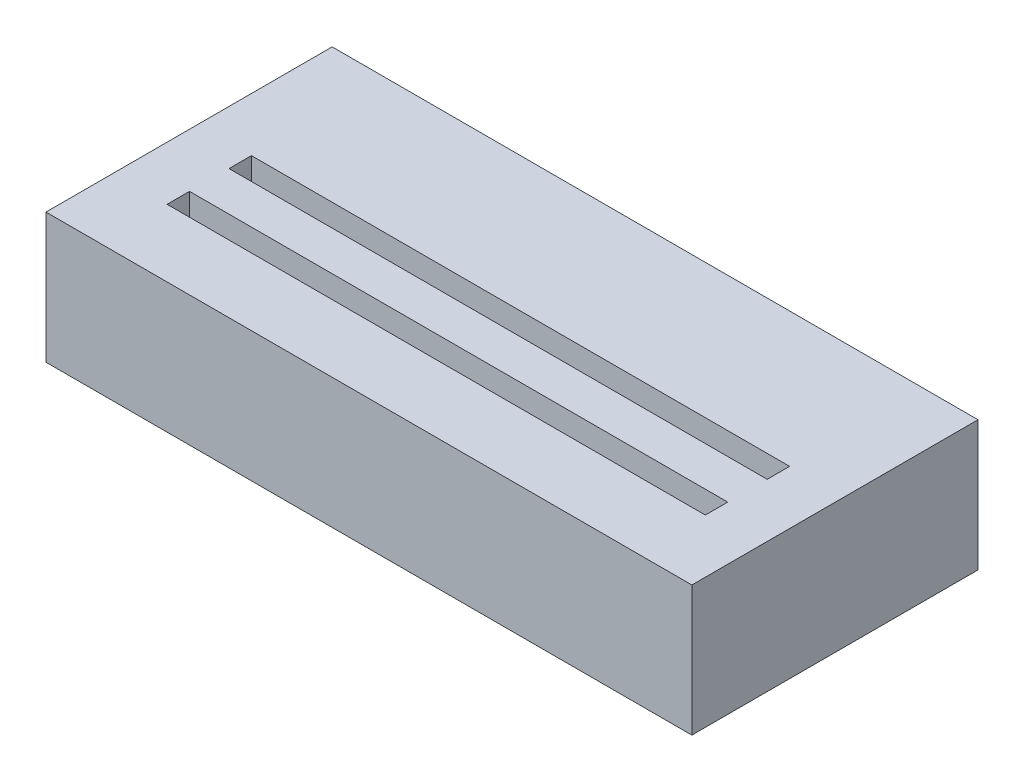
from build123d import *

# Parameters (mm, degrees)
SKETCH1_W           = 36.576
SKETCH1_H           = 7.366
BOSS_EXTRUDE1_DEPTH = 7.62
SKETCH2_R           = 0.508
CUT_EXTRUDE1_DEPTH  = 7.62
SKETCH3_W           = 3.048
SKETCH3_H           = 7.366
BOSS_EXTRUDE2_DEPTH = 1.27
SKETCH4_W           = 36.576
SKETCH4_H           = 7.366
BOSS_EXTRUDE3_DEPTH = 2.2352
SKETCH5_W           = 3.048
SKETCH5_H           = 7.366
BOSS_EXTRUDE4_DEPTH = 1.27
SKETCH6_W           = 36.576
SKETCH6_H           = 7.366
BOSS_EXTRUDE5_DEPTH = 3.81
SKETCH7_W           = 4.826
SKETCH7_H           = 7.62
BOSS_EXTRUDE6_DEPTH = 0.635


with BuildPart() as part:
    # Sketch1 → Boss-Extrude1 (new body)
    with BuildSketch(Plane.XY):
        with Locations((13.97, 1.27)):
            Rectangle(SKETCH1_W, SKETCH1_H)
    extrude(amount=BOSS_EXTRUDE1_DEPTH)

    # Sketch2 → Cut-Extrude1 (cut)
    with BuildSketch(Plane(origin=(0, 0, 0), x_dir=(-1, 0, 0), z_dir=(0, 0, -1))):
        Circle(SKETCH2_R)
        with Locations((-2.54, 0)):
            Circle(SKETCH2_R)
        with Locations((-5.08, 0)):
            Circle(SKETCH2_R)
        with Locations((-7.62, 0)):
            Circle(SKETCH2_R)
        with Locations((-10.16, 0)):
            Circle(SKETCH2_R)
        with Locations((-12.7, 0)):
            Circle(SKETCH2_R)
        with Locations((-15.24, 0)):
            Circle(SKETCH2_R)
        with Locations((-17.78, 0)):
            Circle(SKETCH2_R)
        with Locations((-20.32, 0)):
            Circle(SKETCH2_R)
        with Locations((-22.86, 0)):
            Circle(SKETCH2_R)
        with Locations((-25.4, 0)):
            Circle(SKETCH2_R)
        with Locations((-27.94, 0)):
            Circle(SKETCH2_R)
        with Locations((0, 2.54)):
            Circle(SKETCH2_R)
        with Locations((-2.54, 2.54)):
            Circle(SKETCH2_R)
        with Locations((-5.08, 2.54)):
            Circle(SKETCH2_R)
        with Locations((-7.62, 2.54)):
            Circle(SKETCH2_R)
        with Locations((-10.16, 2.54)):
            Circle(SKETCH2_R)
        with Locations((-12.7, 2.54)):
            Circle(SKETCH2_R)
        with Locations((-15.24, 2.54)):
            Circle(SKETCH2_R)
        with Locations((-17.78, 2.54)):
            Circle(SKETCH2_R)
        with Locations((-20.32, 2.54)):
            Circle(SKETCH2_R)
        with Locations((-22.86, 2.54)):
            Circle(SKETCH2_R)
        with Locations((-25.4, 2.54)):
            Circle(SKETCH2_R)
        with Locations((-27.94, 2.54)):
            Circle(SKETCH2_R)
    extrude(amount=-CUT_EXTRUDE1_DEPTH, mode=Mode.SUBTRACT)

    # Sketch3 → Boss-Extrude2 (add)
    with BuildSketch(Plane.XY.offset(7.62)):
        with Locations((-2.794, 1.27)):
            Rectangle(SKETCH3_W, SKETCH3_H)
        with Locations((30.734, 1.27)):
            Rectangle(SKETCH3_W, SKETCH3_H)
    extrude(amount=BOSS_EXTRUDE2_DEPTH)

    # Sketch4 → Boss-Extrude3 (add)
    with BuildSketch(Plane.XY.offset(8.89)):
        with Locations((13.97, 1.27)):
            Rectangle(SKETCH4_W, SKETCH4_H)
    extrude(amount=BOSS_EXTRUDE3_DEPTH)

    # Sketch5 → Boss-Extrude4 (add)
    with BuildSketch(Plane.XY.offset(11.1252)):
        with Locations((-2.794, 1.27)):
            Rectangle(SKETCH5_W, SKETCH5_H)
        with Locations((30.734, 1.27)):
            Rectangle(SKETCH5_W, SKETCH5_H)
    extrude(amount=BOSS_EXTRUDE4_DEPTH)

    # Sketch6 → Boss-Extrude5 (add)
    with BuildSketch(Plane.XY.offset(12.3952)):
        with Locations((13.97, 1.27)):
            Rectangle(SKETCH6_W, SKETCH6_H)
    extrude(amount=BOSS_EXTRUDE5_DEPTH)

    # Sketch7 → Boss-Extrude6 (add)
    with BuildSketch(Plane.XZ.offset(2.413)):
        with Locations((13.97, 3.81)):
            Rectangle(SKETCH7_W, SKETCH7_H)
    extrude(amount=BOSS_EXTRUDE6_DEPTH)


solid = part.part
